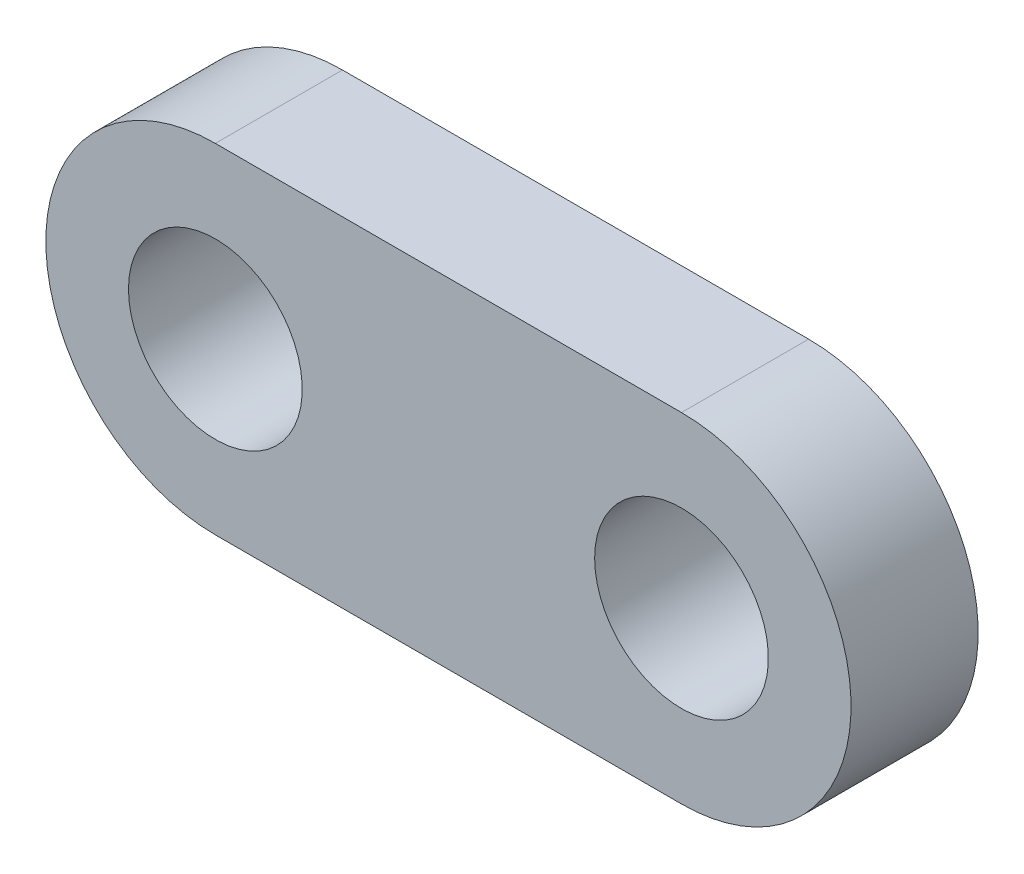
from build123d import *

# Parameters (mm, degrees)
ESQUISSE1_R        = 4.1
BOSS_EXTRU_1_DEPTH = 6


with BuildPart() as part:
    # Esquisse1 → Boss.-Extru.1 (new body)
    with BuildSketch(Plane.XY.offset(6)):
        with BuildLine():
            Line((22, 8), (0, 8))
            ThreePointArc((0, 8), (-8, 0), (0, -8))
            Line((0, -8), (22, -8))
            ThreePointArc((22, -8), (30, 0), (22, 8))
        make_face()
        with Locations(Location((0, 0, 0), (0, 0, 180))):
            Circle(ESQUISSE1_R, mode=Mode.SUBTRACT)
        with Locations(Location((22, 0, 0), (0, 0, 180))):
            Circle(ESQUISSE1_R, mode=Mode.SUBTRACT)
    extrude(amount=-BOSS_EXTRU_1_DEPTH)


solid = part.part
